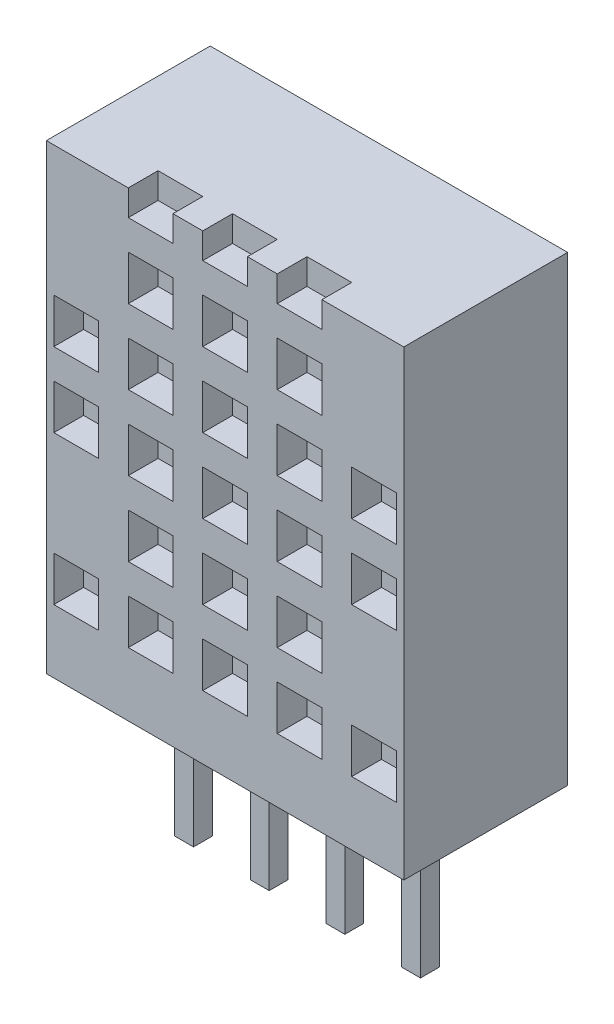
from build123d import *

# Parameters (mm, degrees)
SKETCH1_W          = 12
SKETCH1_H          = 15.5
BODY_DEPTH         = 5.5
SKETCH2_W          = 0.635
SKETCH2_H          = 0.635
PINS_DEPTH         = 5
SKETCH3_W          = 1.5
SKETCH3_H          = 1.5
CUT_EXTRUDE1_DEPTH = 1


with BuildPart() as part:
    # Sketch1 → Body (new body)
    with BuildSketch(Plane.XY):
        with Locations((6, 7.75)):
            Rectangle(SKETCH1_W, SKETCH1_H)
    extrude(amount=BODY_DEPTH)

    # Sketch2 → Pins (add)
    with BuildSketch(Plane.XZ):
        with Locations((4.73, 2.75)):
            Rectangle(SKETCH2_W, SKETCH2_H)
        with Locations((2.19, 2.75)):
            Rectangle(SKETCH2_W, SKETCH2_H)
        with Locations((7.27, 2.75)):
            Rectangle(SKETCH2_W, SKETCH2_H)
        with Locations((9.81, 2.75)):
            Rectangle(SKETCH2_W, SKETCH2_H)
    extrude(amount=PINS_DEPTH)

    # Sketch3 → Cut-Extrude1 (cut)
    with BuildSketch(Plane.XY.offset(5.5)):
        with Locations((1, 2.884207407)):
            Rectangle(SKETCH3_W, SKETCH3_H)
        with Locations((3.5, 2.884207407)):
            Rectangle(SKETCH3_W, SKETCH3_H)
        with Locations((6, 2.884207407)):
            Rectangle(SKETCH3_W, SKETCH3_H)
        with Locations((8.5, 2.884207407)):
            Rectangle(SKETCH3_W, SKETCH3_H)
        with Locations((11, 2.884207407)):
            Rectangle(SKETCH3_W, SKETCH3_H)
        with Locations((3.5, 5.384207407)):
            Rectangle(SKETCH3_W, SKETCH3_H)
        with Locations((6, 5.384207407)):
            Rectangle(SKETCH3_W, SKETCH3_H)
        with Locations((8.5, 5.384207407)):
            Rectangle(SKETCH3_W, SKETCH3_H)
        with Locations((3.5, 7.884207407)):
            Rectangle(SKETCH3_W, SKETCH3_H)
        with Locations((6, 7.884207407)):
            Rectangle(SKETCH3_W, SKETCH3_H)
        with Locations((8.5, 7.884207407)):
            Rectangle(SKETCH3_W, SKETCH3_H)
        with Locations((11, 7.884207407)):
            Rectangle(SKETCH3_W, SKETCH3_H)
        with Locations((3.5, 10.384207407)):
            Rectangle(SKETCH3_W, SKETCH3_H)
        with Locations((6, 10.384207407)):
            Rectangle(SKETCH3_W, SKETCH3_H)
        with Locations((8.5, 10.384207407)):
            Rectangle(SKETCH3_W, SKETCH3_H)
        with Locations((11, 10.384207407)):
            Rectangle(SKETCH3_W, SKETCH3_H)
        with Locations((3.5, 12.884207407)):
            Rectangle(SKETCH3_W, SKETCH3_H)
        with Locations((6, 12.884207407)):
            Rectangle(SKETCH3_W, SKETCH3_H)
        with Locations((8.5, 12.884207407)):
            Rectangle(SKETCH3_W, SKETCH3_H)
        with Locations((3.5, 15.384207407)):
            Rectangle(SKETCH3_W, SKETCH3_H)
        with Locations((6, 15.384207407)):
            Rectangle(SKETCH3_W, SKETCH3_H)
        with Locations((8.5, 15.384207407)):
            Rectangle(SKETCH3_W, SKETCH3_H)
        with Locations((1, 7.884207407)):
            Rectangle(SKETCH3_W, SKETCH3_H)
        with Locations((1, 10.384207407)):
            Rectangle(SKETCH3_W, SKETCH3_H)
    extrude(amount=-CUT_EXTRUDE1_DEPTH, mode=Mode.SUBTRACT)


solid = part.part
